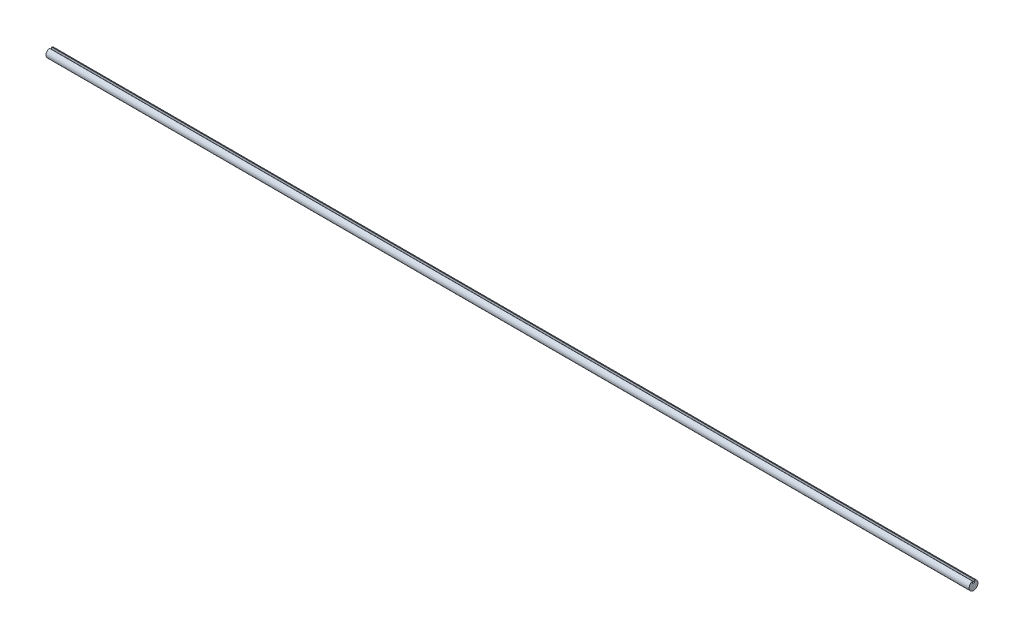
ISO-10303-21;
HEADER;
FILE_DESCRIPTION(('STEP AP214'),'2;1');
FILE_NAME('part.step','',(''),(''),'','','');
FILE_SCHEMA(('AUTOMOTIVE_DESIGN { 1 0 10303 214 1 1 1 1 }'));
ENDSEC;
DATA;
#1=APPLICATION_CONTEXT('core data for automotive mechanical design processes');
#2=APPLICATION_PROTOCOL_DEFINITION('international standard','automotive_design',2000,#1);
#3=PRODUCT_CONTEXT('',#1,'mechanical');
#4=PRODUCT('Part','Part','',(#3));
#5=PRODUCT_RELATED_PRODUCT_CATEGORY('part','',(#4));
#6=PRODUCT_DEFINITION_FORMATION('','',#4);
#7=PRODUCT_DEFINITION_CONTEXT('part definition',#1,'design');
#8=PRODUCT_DEFINITION('design','',#6,#7);
#9=PRODUCT_DEFINITION_SHAPE('','',#8);
#10=(LENGTH_UNIT() NAMED_UNIT(*) SI_UNIT(.MILLI.,.METRE.));
#11=(NAMED_UNIT(*) PLANE_ANGLE_UNIT() SI_UNIT($,.RADIAN.));
#12=(NAMED_UNIT(*) SI_UNIT($,.STERADIAN.) SOLID_ANGLE_UNIT());
#13=UNCERTAINTY_MEASURE_WITH_UNIT(LENGTH_MEASURE(1.E-05),#10,'distance_accuracy_value','');
#14=(GEOMETRIC_REPRESENTATION_CONTEXT(3) GLOBAL_UNCERTAINTY_ASSIGNED_CONTEXT((#13)) GLOBAL_UNIT_ASSIGNED_CONTEXT((#10,
#11,#12)) REPRESENTATION_CONTEXT('',''));
#15=CARTESIAN_POINT('',(0.,0.,0.));
#16=DIRECTION('',(0.,0.,1.));
#17=DIRECTION('',(1.,0.,0.));
#18=AXIS2_PLACEMENT_3D('',#15,#16,#17);
#19=CARTESIAN_POINT('',(660.4,3.175,1.5875));
#20=DIRECTION('',(0.,-1.,0.));
#21=DIRECTION('',(0.,0.,-1.));
#22=AXIS2_PLACEMENT_3D('',#19,#20,#21);
#23=PLANE('',#22);
#24=DIRECTION('',(0.,0.,1.));
#25=VECTOR('',#24,1.);
#26=CARTESIAN_POINT('',(-660.4,3.175,1.5875));
#27=LINE('',#26,#25);
#28=CARTESIAN_POINT('',(-660.4,3.175,-1.5875));
#29=VERTEX_POINT('',#28);
#30=CARTESIAN_POINT('',(-660.4,3.175,1.5875));
#31=VERTEX_POINT('',#30);
#32=EDGE_CURVE('E96',#29,#31,#27,.T.);
#33=ORIENTED_EDGE('',*,*,#32,.T.);
#34=DIRECTION('',(-1.,0.,0.));
#35=VECTOR('',#34,1.);
#36=CARTESIAN_POINT('',(660.4,3.175,1.5875));
#37=LINE('',#36,#35);
#38=CARTESIAN_POINT('',(660.4,3.175,1.5875));
#39=VERTEX_POINT('',#38);
#40=EDGE_CURVE('E11',#39,#31,#37,.T.);
#41=ORIENTED_EDGE('',*,*,#40,.F.);
#42=DIRECTION('',(0.,0.,1.));
#43=VECTOR('',#42,1.);
#44=CARTESIAN_POINT('',(660.4,3.175,1.5875));
#45=LINE('',#44,#43);
#46=CARTESIAN_POINT('',(660.4,3.175,-1.5875));
#47=VERTEX_POINT('',#46);
#48=EDGE_CURVE('E84',#47,#39,#45,.T.);
#49=ORIENTED_EDGE('',*,*,#48,.F.);
#50=DIRECTION('',(-1.,0.,0.));
#51=VECTOR('',#50,1.);
#52=CARTESIAN_POINT('',(660.4,3.175,-1.5875));
#53=LINE('',#52,#51);
#54=EDGE_CURVE('E92',#47,#29,#53,.T.);
#55=ORIENTED_EDGE('',*,*,#54,.T.);
#56=EDGE_LOOP('',(#33,#41,#49,#55));
#57=FACE_BOUND('',#56,.T.);
#58=ADVANCED_FACE('F33',(#57),#23,.F.);
#59=CARTESIAN_POINT('',(660.4,6.14836106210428,1.5875));
#60=DIRECTION('',(0.,0.,1.));
#61=DIRECTION('',(0.,-1.,0.));
#62=AXIS2_PLACEMENT_3D('',#59,#60,#61);
#63=PLANE('',#62);
#64=DIRECTION('',(0.,1.,0.));
#65=VECTOR('',#64,1.);
#66=CARTESIAN_POINT('',(-660.4,6.14836106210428,1.5875));
#67=LINE('',#66,#65);
#68=CARTESIAN_POINT('',(-660.4,6.14836106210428,1.5875));
#69=VERTEX_POINT('',#68);
#70=EDGE_CURVE('E88',#31,#69,#67,.T.);
#71=ORIENTED_EDGE('',*,*,#70,.T.);
#72=DIRECTION('',(-1.,0.,0.));
#73=VECTOR('',#72,1.);
#74=CARTESIAN_POINT('',(660.4,6.14836106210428,1.5875));
#75=LINE('',#74,#73);
#76=CARTESIAN_POINT('',(660.4,6.14836106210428,1.5875));
#77=VERTEX_POINT('',#76);
#78=EDGE_CURVE('E41',#77,#69,#75,.T.);
#79=ORIENTED_EDGE('',*,*,#78,.F.);
#80=DIRECTION('',(0.,1.,0.));
#81=VECTOR('',#80,1.);
#82=CARTESIAN_POINT('',(660.4,6.14836106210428,1.5875));
#83=LINE('',#82,#81);
#84=EDGE_CURVE('E79',#39,#77,#83,.T.);
#85=ORIENTED_EDGE('',*,*,#84,.F.);
#86=ORIENTED_EDGE('',*,*,#40,.T.);
#87=EDGE_LOOP('',(#71,#79,#85,#86));
#88=FACE_BOUND('',#87,.T.);
#89=ADVANCED_FACE('F87',(#88),#63,.F.);
#90=CARTESIAN_POINT('',(660.4,0.,0.));
#91=DIRECTION('',(-1.,0.,0.));
#92=DIRECTION('',(0.,0.,1.));
#93=AXIS2_PLACEMENT_3D('',#90,#91,#92);
#94=CYLINDRICAL_SURFACE('',#93,6.35);
#95=CARTESIAN_POINT('',(-660.4,0.,0.));
#96=DIRECTION('',(1.,0.,0.));
#97=DIRECTION('',(0.,0.,-1.));
#98=AXIS2_PLACEMENT_3D('',#95,#96,#97);
#99=CIRCLE('',#98,6.35);
#100=CARTESIAN_POINT('',(-660.4,6.14836106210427,-1.5875));
#101=VERTEX_POINT('',#100);
#102=EDGE_CURVE('E66',#69,#101,#99,.T.);
#103=ORIENTED_EDGE('',*,*,#102,.T.);
#104=DIRECTION('',(-1.,0.,0.));
#105=VECTOR('',#104,1.);
#106=CARTESIAN_POINT('',(660.4,6.14836106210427,-1.5875));
#107=LINE('',#106,#105);
#108=CARTESIAN_POINT('',(660.4,6.14836106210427,-1.5875));
#109=VERTEX_POINT('',#108);
#110=EDGE_CURVE('E89',#109,#101,#107,.T.);
#111=ORIENTED_EDGE('',*,*,#110,.F.);
#112=CARTESIAN_POINT('',(660.4,0.,0.));
#113=DIRECTION('',(1.,0.,0.));
#114=DIRECTION('',(0.,0.,-1.));
#115=AXIS2_PLACEMENT_3D('',#112,#113,#114);
#116=CIRCLE('',#115,6.35);
#117=EDGE_CURVE('E82',#77,#109,#116,.T.);
#118=ORIENTED_EDGE('',*,*,#117,.F.);
#119=ORIENTED_EDGE('',*,*,#78,.T.);
#120=EDGE_LOOP('',(#103,#111,#118,#119));
#121=FACE_BOUND('',#120,.T.);
#122=ADVANCED_FACE('F90',(#121),#94,.T.);
#123=CARTESIAN_POINT('',(660.4,6.14836106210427,-1.5875));
#124=DIRECTION('',(0.,0.,-1.));
#125=DIRECTION('',(0.,1.,0.));
#126=AXIS2_PLACEMENT_3D('',#123,#124,#125);
#127=PLANE('',#126);
#128=DIRECTION('',(0.,-1.,0.));
#129=VECTOR('',#128,1.);
#130=CARTESIAN_POINT('',(-660.4,6.14836106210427,-1.5875));
#131=LINE('',#130,#129);
#132=EDGE_CURVE('E72',#101,#29,#131,.T.);
#133=ORIENTED_EDGE('',*,*,#132,.T.);
#134=ORIENTED_EDGE('',*,*,#54,.F.);
#135=DIRECTION('',(0.,-1.,0.));
#136=VECTOR('',#135,1.);
#137=CARTESIAN_POINT('',(660.4,6.14836106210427,-1.5875));
#138=LINE('',#137,#136);
#139=EDGE_CURVE('E49',#109,#47,#138,.T.);
#140=ORIENTED_EDGE('',*,*,#139,.F.);
#141=ORIENTED_EDGE('',*,*,#110,.T.);
#142=EDGE_LOOP('',(#133,#134,#140,#141));
#143=FACE_BOUND('',#142,.T.);
#144=ADVANCED_FACE('F103',(#143),#127,.F.);
#145=CARTESIAN_POINT('',(660.4,0.,0.));
#146=DIRECTION('',(1.,0.,0.));
#147=DIRECTION('',(0.,0.,-1.));
#148=AXIS2_PLACEMENT_3D('',#145,#146,#147);
#149=PLANE('',#148);
#150=ORIENTED_EDGE('',*,*,#48,.T.);
#151=ORIENTED_EDGE('',*,*,#84,.T.);
#152=ORIENTED_EDGE('',*,*,#117,.T.);
#153=ORIENTED_EDGE('',*,*,#139,.T.);
#154=EDGE_LOOP('',(#150,#151,#152,#153));
#155=FACE_BOUND('',#154,.T.);
#156=ADVANCED_FACE('F80',(#155),#149,.T.);
#157=CARTESIAN_POINT('',(-660.4,0.,0.));
#158=DIRECTION('',(1.,0.,0.));
#159=DIRECTION('',(0.,0.,-1.));
#160=AXIS2_PLACEMENT_3D('',#157,#158,#159);
#161=PLANE('',#160);
#162=ORIENTED_EDGE('',*,*,#32,.F.);
#163=ORIENTED_EDGE('',*,*,#132,.F.);
#164=ORIENTED_EDGE('',*,*,#102,.F.);
#165=ORIENTED_EDGE('',*,*,#70,.F.);
#166=EDGE_LOOP('',(#162,#163,#164,#165));
#167=FACE_BOUND('',#166,.T.);
#168=ADVANCED_FACE('F106',(#167),#161,.F.);
#169=CLOSED_SHELL('',(#58,#89,#122,#144,#156,#168));
#170=MANIFOLD_SOLID_BREP('B2',#169);
#171=ADVANCED_BREP_SHAPE_REPRESENTATION('',(#18,#170),#14);
#172=SHAPE_DEFINITION_REPRESENTATION(#9,#171);
ENDSEC;
END-ISO-10303-21;
